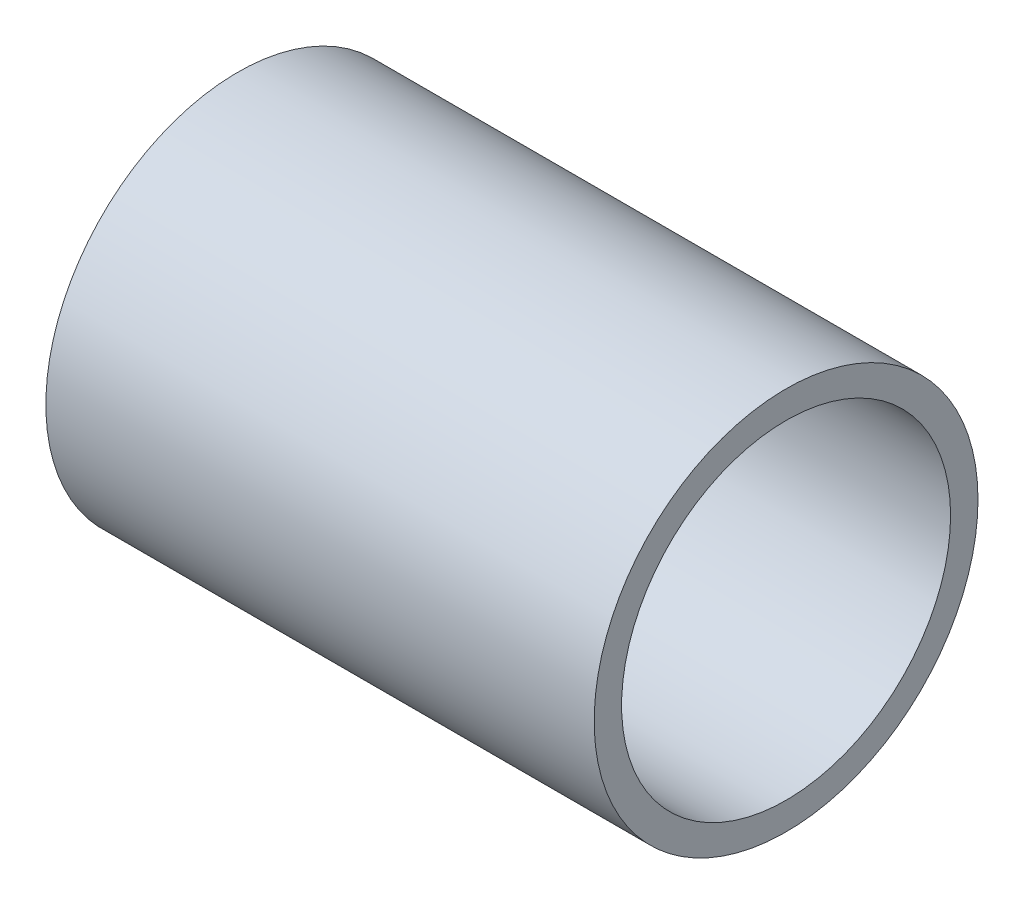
ISO-10303-21;
HEADER;
FILE_DESCRIPTION(('STEP AP214'),'2;1');
FILE_NAME('part.step','',(''),(''),'','','');
FILE_SCHEMA(('AUTOMOTIVE_DESIGN { 1 0 10303 214 1 1 1 1 }'));
ENDSEC;
DATA;
#1=APPLICATION_CONTEXT('core data for automotive mechanical design processes');
#2=APPLICATION_PROTOCOL_DEFINITION('international standard','automotive_design',2000,#1);
#3=PRODUCT_CONTEXT('',#1,'mechanical');
#4=PRODUCT('Part','Part','',(#3));
#5=PRODUCT_RELATED_PRODUCT_CATEGORY('part','',(#4));
#6=PRODUCT_DEFINITION_FORMATION('','',#4);
#7=PRODUCT_DEFINITION_CONTEXT('part definition',#1,'design');
#8=PRODUCT_DEFINITION('design','',#6,#7);
#9=PRODUCT_DEFINITION_SHAPE('','',#8);
#10=(LENGTH_UNIT() NAMED_UNIT(*) SI_UNIT(.MILLI.,.METRE.));
#11=(NAMED_UNIT(*) PLANE_ANGLE_UNIT() SI_UNIT($,.RADIAN.));
#12=(NAMED_UNIT(*) SI_UNIT($,.STERADIAN.) SOLID_ANGLE_UNIT());
#13=UNCERTAINTY_MEASURE_WITH_UNIT(LENGTH_MEASURE(1.E-05),#10,'distance_accuracy_value','');
#14=(GEOMETRIC_REPRESENTATION_CONTEXT(3) GLOBAL_UNCERTAINTY_ASSIGNED_CONTEXT((#13)) GLOBAL_UNIT_ASSIGNED_CONTEXT((#10,
#11,#12)) REPRESENTATION_CONTEXT('',''));
#15=CARTESIAN_POINT('',(0.,0.,0.));
#16=DIRECTION('',(0.,0.,1.));
#17=DIRECTION('',(1.,0.,0.));
#18=AXIS2_PLACEMENT_3D('',#15,#16,#17);
#19=CARTESIAN_POINT('',(127.,0.,0.));
#20=DIRECTION('',(-1.,0.,0.));
#21=DIRECTION('',(0.,0.,1.));
#22=AXIS2_PLACEMENT_3D('',#19,#20,#21);
#23=CYLINDRICAL_SURFACE('',#22,38.1);
#24=CARTESIAN_POINT('',(127.,0.,0.));
#25=DIRECTION('',(1.,0.,0.));
#26=DIRECTION('',(0.,0.,-1.));
#27=AXIS2_PLACEMENT_3D('',#24,#25,#26);
#28=CIRCLE('',#27,38.1);
#29=CARTESIAN_POINT('',(127.,0.,-38.1));
#30=VERTEX_POINT('',#29);
#31=EDGE_CURVE('E53',#30,#30,#28,.T.);
#32=ORIENTED_EDGE('',*,*,#31,.T.);
#33=EDGE_LOOP('',(#32));
#34=FACE_BOUND('',#33,.T.);
#35=CARTESIAN_POINT('',(0.,0.,0.));
#36=DIRECTION('',(1.,0.,0.));
#37=DIRECTION('',(0.,0.,-1.));
#38=AXIS2_PLACEMENT_3D('',#35,#36,#37);
#39=CIRCLE('',#38,38.1);
#40=CARTESIAN_POINT('',(0.,0.,-38.1));
#41=VERTEX_POINT('',#40);
#42=EDGE_CURVE('E60',#41,#41,#39,.T.);
#43=ORIENTED_EDGE('',*,*,#42,.F.);
#44=EDGE_LOOP('',(#43));
#45=FACE_BOUND('',#44,.T.);
#46=ADVANCED_FACE('F45',(#34,#45),#23,.F.);
#47=CARTESIAN_POINT('',(127.,0.,0.));
#48=DIRECTION('',(-1.,0.,0.));
#49=DIRECTION('',(0.,0.,1.));
#50=AXIS2_PLACEMENT_3D('',#47,#48,#49);
#51=CYLINDRICAL_SURFACE('',#50,44.45);
#52=CARTESIAN_POINT('',(127.,0.,0.));
#53=DIRECTION('',(1.,0.,0.));
#54=DIRECTION('',(0.,0.,-1.));
#55=AXIS2_PLACEMENT_3D('',#52,#53,#54);
#56=CIRCLE('',#55,44.45);
#57=CARTESIAN_POINT('',(127.,0.,-44.45));
#58=VERTEX_POINT('',#57);
#59=EDGE_CURVE('E10',#58,#58,#56,.T.);
#60=ORIENTED_EDGE('',*,*,#59,.F.);
#61=EDGE_LOOP('',(#60));
#62=FACE_BOUND('',#61,.T.);
#63=CARTESIAN_POINT('',(0.,0.,0.));
#64=DIRECTION('',(1.,0.,0.));
#65=DIRECTION('',(0.,0.,-1.));
#66=AXIS2_PLACEMENT_3D('',#63,#64,#65);
#67=CIRCLE('',#66,44.45);
#68=CARTESIAN_POINT('',(0.,0.,-44.45));
#69=VERTEX_POINT('',#68);
#70=EDGE_CURVE('E48',#69,#69,#67,.T.);
#71=ORIENTED_EDGE('',*,*,#70,.T.);
#72=EDGE_LOOP('',(#71));
#73=FACE_BOUND('',#72,.T.);
#74=ADVANCED_FACE('F69',(#62,#73),#51,.T.);
#75=CARTESIAN_POINT('',(127.,0.,0.));
#76=DIRECTION('',(1.,0.,0.));
#77=DIRECTION('',(0.,0.,-1.));
#78=AXIS2_PLACEMENT_3D('',#75,#76,#77);
#79=PLANE('',#78);
#80=ORIENTED_EDGE('',*,*,#31,.F.);
#81=EDGE_LOOP('',(#80));
#82=FACE_BOUND('',#81,.T.);
#83=ORIENTED_EDGE('',*,*,#59,.T.);
#84=EDGE_LOOP('',(#83));
#85=FACE_BOUND('',#84,.T.);
#86=ADVANCED_FACE('F73',(#82,#85),#79,.T.);
#87=CARTESIAN_POINT('',(0.,0.,0.));
#88=DIRECTION('',(1.,0.,0.));
#89=DIRECTION('',(0.,0.,-1.));
#90=AXIS2_PLACEMENT_3D('',#87,#88,#89);
#91=PLANE('',#90);
#92=ORIENTED_EDGE('',*,*,#42,.T.);
#93=EDGE_LOOP('',(#92));
#94=FACE_BOUND('',#93,.T.);
#95=ORIENTED_EDGE('',*,*,#70,.F.);
#96=EDGE_LOOP('',(#95));
#97=FACE_BOUND('',#96,.T.);
#98=ADVANCED_FACE('F71',(#94,#97),#91,.F.);
#99=CLOSED_SHELL('',(#46,#74,#86,#98));
#100=MANIFOLD_SOLID_BREP('B2',#99);
#101=ADVANCED_BREP_SHAPE_REPRESENTATION('',(#18,#100),#14);
#102=SHAPE_DEFINITION_REPRESENTATION(#9,#101);
ENDSEC;
END-ISO-10303-21;
